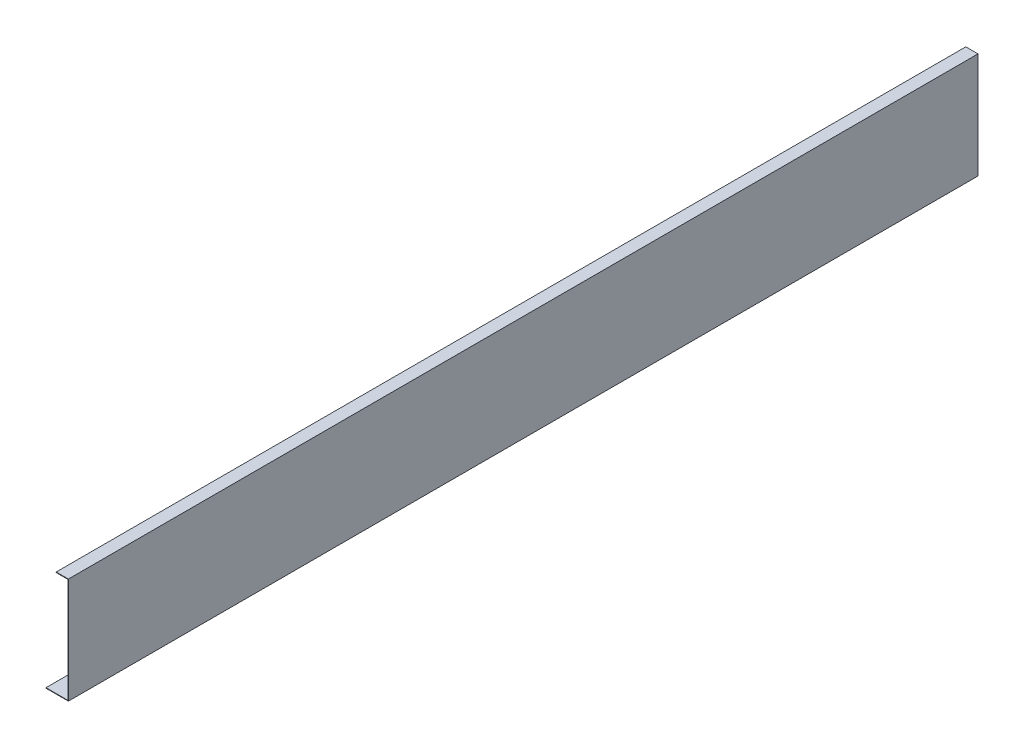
ISO-10303-21;
HEADER;
FILE_DESCRIPTION(('STEP AP214'),'2;1');
FILE_NAME('part.step','',(''),(''),'','','');
FILE_SCHEMA(('AUTOMOTIVE_DESIGN { 1 0 10303 214 1 1 1 1 }'));
ENDSEC;
DATA;
#1=APPLICATION_CONTEXT('core data for automotive mechanical design processes');
#2=APPLICATION_PROTOCOL_DEFINITION('international standard','automotive_design',2000,#1);
#3=PRODUCT_CONTEXT('',#1,'mechanical');
#4=PRODUCT('Part','Part','',(#3));
#5=PRODUCT_RELATED_PRODUCT_CATEGORY('part','',(#4));
#6=PRODUCT_DEFINITION_FORMATION('','',#4);
#7=PRODUCT_DEFINITION_CONTEXT('part definition',#1,'design');
#8=PRODUCT_DEFINITION('design','',#6,#7);
#9=PRODUCT_DEFINITION_SHAPE('','',#8);
#10=(LENGTH_UNIT() NAMED_UNIT(*) SI_UNIT(.MILLI.,.METRE.));
#11=(NAMED_UNIT(*) PLANE_ANGLE_UNIT() SI_UNIT($,.RADIAN.));
#12=(NAMED_UNIT(*) SI_UNIT($,.STERADIAN.) SOLID_ANGLE_UNIT());
#13=UNCERTAINTY_MEASURE_WITH_UNIT(LENGTH_MEASURE(1.E-05),#10,'distance_accuracy_value','');
#14=(GEOMETRIC_REPRESENTATION_CONTEXT(3) GLOBAL_UNCERTAINTY_ASSIGNED_CONTEXT((#13)) GLOBAL_UNIT_ASSIGNED_CONTEXT((#10,
#11,#12)) REPRESENTATION_CONTEXT('',''));
#15=CARTESIAN_POINT('',(0.,0.,0.));
#16=DIRECTION('',(0.,0.,1.));
#17=DIRECTION('',(1.,0.,0.));
#18=AXIS2_PLACEMENT_3D('',#15,#16,#17);
#19=CARTESIAN_POINT('',(0.,20.,1118.));
#20=DIRECTION('',(1.,0.,0.));
#21=DIRECTION('',(0.,0.,-1.));
#22=AXIS2_PLACEMENT_3D('',#19,#20,#21);
#23=PLANE('',#22);
#24=DIRECTION('',(0.,0.,-1.));
#25=VECTOR('',#24,1.);
#26=CARTESIAN_POINT('',(0.,0.,1118.));
#27=LINE('',#26,#25);
#28=CARTESIAN_POINT('',(0.,0.,1085.5));
#29=VERTEX_POINT('',#28);
#30=CARTESIAN_POINT('',(0.,0.,32.5));
#31=VERTEX_POINT('',#30);
#32=EDGE_CURVE('E148',#29,#31,#27,.T.);
#33=ORIENTED_EDGE('',*,*,#32,.F.);
#34=DIRECTION('',(0.,-1.,0.));
#35=VECTOR('',#34,1.);
#36=CARTESIAN_POINT('',(0.,130.,1085.5));
#37=LINE('',#36,#35);
#38=CARTESIAN_POINT('',(0.,20.,1085.5));
#39=VERTEX_POINT('',#38);
#40=EDGE_CURVE('E134',#39,#29,#37,.T.);
#41=ORIENTED_EDGE('',*,*,#40,.F.);
#42=DIRECTION('',(0.,0.,-1.));
#43=VECTOR('',#42,1.);
#44=CARTESIAN_POINT('',(0.,20.,1118.));
#45=LINE('',#44,#43);
#46=CARTESIAN_POINT('',(0.,20.,32.5));
#47=VERTEX_POINT('',#46);
#48=EDGE_CURVE('E184',#39,#47,#45,.T.);
#49=ORIENTED_EDGE('',*,*,#48,.T.);
#50=DIRECTION('',(0.,-1.,0.));
#51=VECTOR('',#50,1.);
#52=CARTESIAN_POINT('',(0.,130.,32.5));
#53=LINE('',#52,#51);
#54=EDGE_CURVE('E153',#47,#31,#53,.T.);
#55=ORIENTED_EDGE('',*,*,#54,.T.);
#56=EDGE_LOOP('',(#33,#41,#49,#55));
#57=FACE_BOUND('',#56,.T.);
#58=ADVANCED_FACE('F33',(#57),#23,.F.);
#59=CARTESIAN_POINT('',(0.,0.,1118.));
#60=DIRECTION('',(0.,1.,0.));
#61=DIRECTION('',(0.,0.,1.));
#62=AXIS2_PLACEMENT_3D('',#59,#60,#61);
#63=PLANE('',#62);
#64=DIRECTION('',(1.,0.,0.));
#65=VECTOR('',#64,1.);
#66=CARTESIAN_POINT('',(0.,0.,1118.));
#67=LINE('',#66,#65);
#68=CARTESIAN_POINT('',(2.5,0.,1118.));
#69=VERTEX_POINT('',#68);
#70=CARTESIAN_POINT('',(30.,0.,1118.));
#71=VERTEX_POINT('',#70);
#72=EDGE_CURVE('E207',#69,#71,#67,.T.);
#73=ORIENTED_EDGE('',*,*,#72,.F.);
#74=DIRECTION('',(0.,0.,1.));
#75=VECTOR('',#74,1.);
#76=CARTESIAN_POINT('',(2.5,0.,1118.));
#77=LINE('',#76,#75);
#78=CARTESIAN_POINT('',(2.5,0.,1085.5));
#79=VERTEX_POINT('',#78);
#80=EDGE_CURVE('E47',#79,#69,#77,.T.);
#81=ORIENTED_EDGE('',*,*,#80,.F.);
#82=DIRECTION('',(1.,0.,0.));
#83=VECTOR('',#82,1.);
#84=CARTESIAN_POINT('',(0.,0.,1085.5));
#85=LINE('',#84,#83);
#86=EDGE_CURVE('E138',#29,#79,#85,.T.);
#87=ORIENTED_EDGE('',*,*,#86,.F.);
#88=ORIENTED_EDGE('',*,*,#32,.T.);
#89=DIRECTION('',(-1.,0.,0.));
#90=VECTOR('',#89,1.);
#91=CARTESIAN_POINT('',(0.,0.,32.5));
#92=LINE('',#91,#90);
#93=CARTESIAN_POINT('',(2.5,0.,32.5));
#94=VERTEX_POINT('',#93);
#95=EDGE_CURVE('E262',#94,#31,#92,.T.);
#96=ORIENTED_EDGE('',*,*,#95,.F.);
#97=DIRECTION('',(0.,0.,1.));
#98=VECTOR('',#97,1.);
#99=CARTESIAN_POINT('',(2.5,0.,0.));
#100=LINE('',#99,#98);
#101=CARTESIAN_POINT('',(2.5,0.,0.));
#102=VERTEX_POINT('',#101);
#103=EDGE_CURVE('E265',#102,#94,#100,.T.);
#104=ORIENTED_EDGE('',*,*,#103,.F.);
#105=DIRECTION('',(1.,0.,0.));
#106=VECTOR('',#105,1.);
#107=CARTESIAN_POINT('',(0.,0.,0.));
#108=LINE('',#107,#106);
#109=CARTESIAN_POINT('',(30.,0.,0.));
#110=VERTEX_POINT('',#109);
#111=EDGE_CURVE('E192',#102,#110,#108,.T.);
#112=ORIENTED_EDGE('',*,*,#111,.T.);
#113=DIRECTION('',(0.,0.,-1.));
#114=VECTOR('',#113,1.);
#115=CARTESIAN_POINT('',(30.,0.,1118.));
#116=LINE('',#115,#114);
#117=EDGE_CURVE('E155',#71,#110,#116,.T.);
#118=ORIENTED_EDGE('',*,*,#117,.F.);
#119=EDGE_LOOP('',(#73,#81,#87,#88,#96,#104,#112,#118));
#120=FACE_BOUND('',#119,.T.);
#121=ADVANCED_FACE('F146',(#120),#63,.F.);
#122=CARTESIAN_POINT('',(30.,0.,1118.));
#123=DIRECTION('',(-1.,0.,0.));
#124=DIRECTION('',(0.,0.,1.));
#125=AXIS2_PLACEMENT_3D('',#122,#123,#124);
#126=PLANE('',#125);
#127=DIRECTION('',(0.,1.,0.));
#128=VECTOR('',#127,1.);
#129=CARTESIAN_POINT('',(30.,0.,0.));
#130=LINE('',#129,#128);
#131=CARTESIAN_POINT('',(30.,130.,0.));
#132=VERTEX_POINT('',#131);
#133=EDGE_CURVE('E194',#110,#132,#130,.T.);
#134=ORIENTED_EDGE('',*,*,#133,.T.);
#135=DIRECTION('',(0.,0.,-1.));
#136=VECTOR('',#135,1.);
#137=CARTESIAN_POINT('',(30.,130.,1118.));
#138=LINE('',#137,#136);
#139=CARTESIAN_POINT('',(30.,130.,1118.));
#140=VERTEX_POINT('',#139);
#141=EDGE_CURVE('E160',#140,#132,#138,.T.);
#142=ORIENTED_EDGE('',*,*,#141,.F.);
#143=DIRECTION('',(0.,1.,0.));
#144=VECTOR('',#143,1.);
#145=CARTESIAN_POINT('',(30.,0.,1118.));
#146=LINE('',#145,#144);
#147=EDGE_CURVE('E251',#71,#140,#146,.T.);
#148=ORIENTED_EDGE('',*,*,#147,.F.);
#149=ORIENTED_EDGE('',*,*,#117,.T.);
#150=EDGE_LOOP('',(#134,#142,#148,#149));
#151=FACE_BOUND('',#150,.T.);
#152=ADVANCED_FACE('F297',(#151),#126,.F.);
#153=CARTESIAN_POINT('',(30.,130.,1118.));
#154=DIRECTION('',(0.,-1.,0.));
#155=DIRECTION('',(0.,0.,-1.));
#156=AXIS2_PLACEMENT_3D('',#153,#154,#155);
#157=PLANE('',#156);
#158=DIRECTION('',(-1.,0.,0.));
#159=VECTOR('',#158,1.);
#160=CARTESIAN_POINT('',(30.,130.,0.));
#161=LINE('',#160,#159);
#162=CARTESIAN_POINT('',(15.,130.,0.));
#163=VERTEX_POINT('',#162);
#164=EDGE_CURVE('E197',#132,#163,#161,.T.);
#165=ORIENTED_EDGE('',*,*,#164,.T.);
#166=DIRECTION('',(0.,0.,-1.));
#167=VECTOR('',#166,1.);
#168=CARTESIAN_POINT('',(15.,130.,1118.));
#169=LINE('',#168,#167);
#170=CARTESIAN_POINT('',(15.,130.,1118.));
#171=VERTEX_POINT('',#170);
#172=EDGE_CURVE('E220',#171,#163,#169,.T.);
#173=ORIENTED_EDGE('',*,*,#172,.F.);
#174=DIRECTION('',(-1.,0.,0.));
#175=VECTOR('',#174,1.);
#176=CARTESIAN_POINT('',(30.,130.,1118.));
#177=LINE('',#176,#175);
#178=EDGE_CURVE('E229',#140,#171,#177,.T.);
#179=ORIENTED_EDGE('',*,*,#178,.F.);
#180=ORIENTED_EDGE('',*,*,#141,.T.);
#181=EDGE_LOOP('',(#165,#173,#179,#180));
#182=FACE_BOUND('',#181,.T.);
#183=ADVANCED_FACE('F227',(#182),#157,.F.);
#184=CARTESIAN_POINT('',(15.,130.,1118.));
#185=DIRECTION('',(1.,0.,0.));
#186=DIRECTION('',(0.,0.,-1.));
#187=AXIS2_PLACEMENT_3D('',#184,#185,#186);
#188=PLANE('',#187);
#189=DIRECTION('',(0.,-1.,0.));
#190=VECTOR('',#189,1.);
#191=CARTESIAN_POINT('',(15.,130.,0.));
#192=LINE('',#191,#190);
#193=CARTESIAN_POINT('',(15.,129.35,0.));
#194=VERTEX_POINT('',#193);
#195=EDGE_CURVE('E199',#163,#194,#192,.T.);
#196=ORIENTED_EDGE('',*,*,#195,.T.);
#197=DIRECTION('',(0.,0.,-1.));
#198=VECTOR('',#197,1.);
#199=CARTESIAN_POINT('',(15.,129.35,1118.));
#200=LINE('',#199,#198);
#201=CARTESIAN_POINT('',(15.,129.35,1118.));
#202=VERTEX_POINT('',#201);
#203=EDGE_CURVE('E217',#202,#194,#200,.T.);
#204=ORIENTED_EDGE('',*,*,#203,.F.);
#205=DIRECTION('',(0.,-1.,0.));
#206=VECTOR('',#205,1.);
#207=CARTESIAN_POINT('',(15.,130.,1118.));
#208=LINE('',#207,#206);
#209=EDGE_CURVE('E247',#171,#202,#208,.T.);
#210=ORIENTED_EDGE('',*,*,#209,.F.);
#211=ORIENTED_EDGE('',*,*,#172,.T.);
#212=EDGE_LOOP('',(#196,#204,#210,#211));
#213=FACE_BOUND('',#212,.T.);
#214=ADVANCED_FACE('F241',(#213),#188,.F.);
#215=CARTESIAN_POINT('',(15.,129.35,1118.));
#216=DIRECTION('',(0.,1.,0.));
#217=DIRECTION('',(0.,0.,1.));
#218=AXIS2_PLACEMENT_3D('',#215,#216,#217);
#219=PLANE('',#218);
#220=DIRECTION('',(1.,0.,0.));
#221=VECTOR('',#220,1.);
#222=CARTESIAN_POINT('',(15.,129.35,0.));
#223=LINE('',#222,#221);
#224=CARTESIAN_POINT('',(29.35,129.35,0.));
#225=VERTEX_POINT('',#224);
#226=EDGE_CURVE('E201',#194,#225,#223,.T.);
#227=ORIENTED_EDGE('',*,*,#226,.T.);
#228=DIRECTION('',(0.,0.,-1.));
#229=VECTOR('',#228,1.);
#230=CARTESIAN_POINT('',(29.35,129.35,1118.));
#231=LINE('',#230,#229);
#232=CARTESIAN_POINT('',(29.35,129.35,1118.));
#233=VERTEX_POINT('',#232);
#234=EDGE_CURVE('E214',#233,#225,#231,.T.);
#235=ORIENTED_EDGE('',*,*,#234,.F.);
#236=DIRECTION('',(1.,0.,0.));
#237=VECTOR('',#236,1.);
#238=CARTESIAN_POINT('',(15.,129.35,1118.));
#239=LINE('',#238,#237);
#240=EDGE_CURVE('E188',#202,#233,#239,.T.);
#241=ORIENTED_EDGE('',*,*,#240,.F.);
#242=ORIENTED_EDGE('',*,*,#203,.T.);
#243=EDGE_LOOP('',(#227,#235,#241,#242));
#244=FACE_BOUND('',#243,.T.);
#245=ADVANCED_FACE('F245',(#244),#219,.F.);
#246=CARTESIAN_POINT('',(29.35,129.35,1118.));
#247=DIRECTION('',(1.,0.,0.));
#248=DIRECTION('',(0.,1.,0.));
#249=AXIS2_PLACEMENT_3D('',#246,#247,#248);
#250=PLANE('',#249);
#251=DIRECTION('',(0.,-1.,0.));
#252=VECTOR('',#251,1.);
#253=CARTESIAN_POINT('',(29.35,129.35,0.));
#254=LINE('',#253,#252);
#255=CARTESIAN_POINT('',(29.35,0.650000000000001,0.));
#256=VERTEX_POINT('',#255);
#257=EDGE_CURVE('E203',#225,#256,#254,.T.);
#258=ORIENTED_EDGE('',*,*,#257,.T.);
#259=DIRECTION('',(0.,0.,-1.));
#260=VECTOR('',#259,1.);
#261=CARTESIAN_POINT('',(29.35,0.650000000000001,1118.));
#262=LINE('',#261,#260);
#263=CARTESIAN_POINT('',(29.35,0.650000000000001,1118.));
#264=VERTEX_POINT('',#263);
#265=EDGE_CURVE('E212',#264,#256,#262,.T.);
#266=ORIENTED_EDGE('',*,*,#265,.F.);
#267=DIRECTION('',(0.,-1.,0.));
#268=VECTOR('',#267,1.);
#269=CARTESIAN_POINT('',(29.35,129.35,1118.));
#270=LINE('',#269,#268);
#271=EDGE_CURVE('E182',#233,#264,#270,.T.);
#272=ORIENTED_EDGE('',*,*,#271,.F.);
#273=ORIENTED_EDGE('',*,*,#234,.T.);
#274=EDGE_LOOP('',(#258,#266,#272,#273));
#275=FACE_BOUND('',#274,.T.);
#276=ADVANCED_FACE('F310',(#275),#250,.F.);
#277=CARTESIAN_POINT('',(29.35,0.650000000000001,1118.));
#278=DIRECTION('',(0.,-1.,0.));
#279=DIRECTION('',(1.,0.,0.));
#280=AXIS2_PLACEMENT_3D('',#277,#278,#279);
#281=PLANE('',#280);
#282=DIRECTION('',(1.,0.,0.));
#283=VECTOR('',#282,1.);
#284=CARTESIAN_POINT('',(29.35,0.650000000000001,1085.5));
#285=LINE('',#284,#283);
#286=CARTESIAN_POINT('',(0.650000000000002,0.649999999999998,1085.5));
#287=VERTEX_POINT('',#286);
#288=CARTESIAN_POINT('',(2.5,0.650000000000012,1085.5));
#289=VERTEX_POINT('',#288);
#290=EDGE_CURVE('E177',#287,#289,#285,.T.);
#291=ORIENTED_EDGE('',*,*,#290,.T.);
#292=DIRECTION('',(0.,0.,1.));
#293=VECTOR('',#292,1.);
#294=CARTESIAN_POINT('',(2.5,0.649999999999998,1118.));
#295=LINE('',#294,#293);
#296=CARTESIAN_POINT('',(2.5,0.650000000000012,1118.));
#297=VERTEX_POINT('',#296);
#298=EDGE_CURVE('E167',#289,#297,#295,.T.);
#299=ORIENTED_EDGE('',*,*,#298,.T.);
#300=DIRECTION('',(-1.,0.,0.));
#301=VECTOR('',#300,1.);
#302=CARTESIAN_POINT('',(29.35,0.650000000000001,1118.));
#303=LINE('',#302,#301);
#304=EDGE_CURVE('E175',#264,#297,#303,.T.);
#305=ORIENTED_EDGE('',*,*,#304,.F.);
#306=ORIENTED_EDGE('',*,*,#265,.T.);
#307=DIRECTION('',(-1.,0.,0.));
#308=VECTOR('',#307,1.);
#309=CARTESIAN_POINT('',(29.35,0.650000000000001,0.));
#310=LINE('',#309,#308);
#311=CARTESIAN_POINT('',(2.50000000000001,0.649999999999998,0.));
#312=VERTEX_POINT('',#311);
#313=EDGE_CURVE('E205',#256,#312,#310,.T.);
#314=ORIENTED_EDGE('',*,*,#313,.T.);
#315=DIRECTION('',(0.,0.,1.));
#316=VECTOR('',#315,1.);
#317=CARTESIAN_POINT('',(2.5,0.649999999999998,1118.));
#318=LINE('',#317,#316);
#319=CARTESIAN_POINT('',(2.5,0.650000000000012,32.5));
#320=VERTEX_POINT('',#319);
#321=EDGE_CURVE('E55',#312,#320,#318,.T.);
#322=ORIENTED_EDGE('',*,*,#321,.T.);
#323=DIRECTION('',(-1.,0.,0.));
#324=VECTOR('',#323,1.);
#325=CARTESIAN_POINT('',(29.35,0.650000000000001,32.5));
#326=LINE('',#325,#324);
#327=CARTESIAN_POINT('',(0.650000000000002,0.649999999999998,32.5));
#328=VERTEX_POINT('',#327);
#329=EDGE_CURVE('E195',#320,#328,#326,.T.);
#330=ORIENTED_EDGE('',*,*,#329,.T.);
#331=DIRECTION('',(0.,0.,-1.));
#332=VECTOR('',#331,1.);
#333=CARTESIAN_POINT('',(0.650000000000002,0.649999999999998,1118.));
#334=LINE('',#333,#332);
#335=EDGE_CURVE('E210',#287,#328,#334,.T.);
#336=ORIENTED_EDGE('',*,*,#335,.F.);
#337=EDGE_LOOP('',(#291,#299,#305,#306,#314,#322,#330,#336));
#338=FACE_BOUND('',#337,.T.);
#339=ADVANCED_FACE('F173',(#338),#281,.F.);
#340=CARTESIAN_POINT('',(0.65,20.,1118.));
#341=DIRECTION('',(-1.,0.,0.));
#342=DIRECTION('',(0.,-1.,0.));
#343=AXIS2_PLACEMENT_3D('',#340,#341,#342);
#344=PLANE('',#343);
#345=DIRECTION('',(0.,0.,-1.));
#346=VECTOR('',#345,1.);
#347=CARTESIAN_POINT('',(0.65,20.,1118.));
#348=LINE('',#347,#346);
#349=CARTESIAN_POINT('',(0.65,20.,1085.5));
#350=VERTEX_POINT('',#349);
#351=CARTESIAN_POINT('',(0.65,20.,32.5));
#352=VERTEX_POINT('',#351);
#353=EDGE_CURVE('E186',#350,#352,#348,.T.);
#354=ORIENTED_EDGE('',*,*,#353,.F.);
#355=DIRECTION('',(0.,-1.,0.));
#356=VECTOR('',#355,1.);
#357=CARTESIAN_POINT('',(0.65,20.,1085.5));
#358=LINE('',#357,#356);
#359=EDGE_CURVE('E178',#350,#287,#358,.T.);
#360=ORIENTED_EDGE('',*,*,#359,.T.);
#361=ORIENTED_EDGE('',*,*,#335,.T.);
#362=DIRECTION('',(0.,1.,0.));
#363=VECTOR('',#362,1.);
#364=CARTESIAN_POINT('',(0.65,20.,32.5));
#365=LINE('',#364,#363);
#366=EDGE_CURVE('E256',#328,#352,#365,.T.);
#367=ORIENTED_EDGE('',*,*,#366,.T.);
#368=EDGE_LOOP('',(#354,#360,#361,#367));
#369=FACE_BOUND('',#368,.T.);
#370=ADVANCED_FACE('F274',(#369),#344,.F.);
#371=CARTESIAN_POINT('',(0.,20.,1118.));
#372=DIRECTION('',(0.,-1.,0.));
#373=DIRECTION('',(0.,0.,-1.));
#374=AXIS2_PLACEMENT_3D('',#371,#372,#373);
#375=PLANE('',#374);
#376=ORIENTED_EDGE('',*,*,#48,.F.);
#377=DIRECTION('',(1.,0.,0.));
#378=VECTOR('',#377,1.);
#379=CARTESIAN_POINT('',(0.,20.,1085.5));
#380=LINE('',#379,#378);
#381=EDGE_CURVE('E11',#39,#350,#380,.T.);
#382=ORIENTED_EDGE('',*,*,#381,.T.);
#383=ORIENTED_EDGE('',*,*,#353,.T.);
#384=DIRECTION('',(-1.,0.,0.));
#385=VECTOR('',#384,1.);
#386=CARTESIAN_POINT('',(0.,20.,32.5));
#387=LINE('',#386,#385);
#388=EDGE_CURVE('E157',#352,#47,#387,.T.);
#389=ORIENTED_EDGE('',*,*,#388,.T.);
#390=EDGE_LOOP('',(#376,#382,#383,#389));
#391=FACE_BOUND('',#390,.T.);
#392=ADVANCED_FACE('F282',(#391),#375,.F.);
#393=CARTESIAN_POINT('',(0.,0.,1118.));
#394=DIRECTION('',(0.,0.,1.));
#395=DIRECTION('',(1.,0.,0.));
#396=AXIS2_PLACEMENT_3D('',#393,#394,#395);
#397=PLANE('',#396);
#398=DIRECTION('',(0.,1.,0.));
#399=VECTOR('',#398,1.);
#400=CARTESIAN_POINT('',(2.5,0.,1118.));
#401=LINE('',#400,#399);
#402=EDGE_CURVE('E40',#69,#297,#401,.T.);
#403=ORIENTED_EDGE('',*,*,#402,.F.);
#404=ORIENTED_EDGE('',*,*,#72,.T.);
#405=ORIENTED_EDGE('',*,*,#147,.T.);
#406=ORIENTED_EDGE('',*,*,#178,.T.);
#407=ORIENTED_EDGE('',*,*,#209,.T.);
#408=ORIENTED_EDGE('',*,*,#240,.T.);
#409=ORIENTED_EDGE('',*,*,#271,.T.);
#410=ORIENTED_EDGE('',*,*,#304,.T.);
#411=EDGE_LOOP('',(#403,#404,#405,#406,#407,#408,#409,#410));
#412=FACE_BOUND('',#411,.T.);
#413=ADVANCED_FACE('F180',(#412),#397,.T.);
#414=CARTESIAN_POINT('',(0.,0.,0.));
#415=DIRECTION('',(0.,0.,1.));
#416=DIRECTION('',(1.,0.,0.));
#417=AXIS2_PLACEMENT_3D('',#414,#415,#416);
#418=PLANE('',#417);
#419=ORIENTED_EDGE('',*,*,#111,.F.);
#420=DIRECTION('',(0.,1.,0.));
#421=VECTOR('',#420,1.);
#422=CARTESIAN_POINT('',(2.5,0.,0.));
#423=LINE('',#422,#421);
#424=EDGE_CURVE('E154',#102,#312,#423,.T.);
#425=ORIENTED_EDGE('',*,*,#424,.T.);
#426=ORIENTED_EDGE('',*,*,#313,.F.);
#427=ORIENTED_EDGE('',*,*,#257,.F.);
#428=ORIENTED_EDGE('',*,*,#226,.F.);
#429=ORIENTED_EDGE('',*,*,#195,.F.);
#430=ORIENTED_EDGE('',*,*,#164,.F.);
#431=ORIENTED_EDGE('',*,*,#133,.F.);
#432=EDGE_LOOP('',(#419,#425,#426,#427,#428,#429,#430,#431));
#433=FACE_BOUND('',#432,.T.);
#434=ADVANCED_FACE('F236',(#433),#418,.F.);
#435=CARTESIAN_POINT('',(0.,130.,32.5));
#436=DIRECTION('',(0.,0.,1.));
#437=DIRECTION('',(1.,0.,0.));
#438=AXIS2_PLACEMENT_3D('',#435,#436,#437);
#439=PLANE('',#438);
#440=DIRECTION('',(0.,-1.,0.));
#441=VECTOR('',#440,1.);
#442=CARTESIAN_POINT('',(2.5,130.,32.5));
#443=LINE('',#442,#441);
#444=EDGE_CURVE('E260',#320,#94,#443,.T.);
#445=ORIENTED_EDGE('',*,*,#444,.T.);
#446=ORIENTED_EDGE('',*,*,#95,.T.);
#447=ORIENTED_EDGE('',*,*,#54,.F.);
#448=ORIENTED_EDGE('',*,*,#388,.F.);
#449=ORIENTED_EDGE('',*,*,#366,.F.);
#450=ORIENTED_EDGE('',*,*,#329,.F.);
#451=EDGE_LOOP('',(#445,#446,#447,#448,#449,#450));
#452=FACE_BOUND('',#451,.T.);
#453=ADVANCED_FACE('F277',(#452),#439,.F.);
#454=CARTESIAN_POINT('',(2.5,130.,0.));
#455=DIRECTION('',(1.,0.,0.));
#456=DIRECTION('',(0.,0.,-1.));
#457=AXIS2_PLACEMENT_3D('',#454,#455,#456);
#458=PLANE('',#457);
#459=ORIENTED_EDGE('',*,*,#424,.F.);
#460=ORIENTED_EDGE('',*,*,#103,.T.);
#461=ORIENTED_EDGE('',*,*,#444,.F.);
#462=ORIENTED_EDGE('',*,*,#321,.F.);
#463=EDGE_LOOP('',(#459,#460,#461,#462));
#464=FACE_BOUND('',#463,.T.);
#465=ADVANCED_FACE('F279',(#464),#458,.F.);
#466=CARTESIAN_POINT('',(0.,130.,1085.5));
#467=DIRECTION('',(0.,0.,-1.));
#468=DIRECTION('',(-1.,0.,0.));
#469=AXIS2_PLACEMENT_3D('',#466,#467,#468);
#470=PLANE('',#469);
#471=ORIENTED_EDGE('',*,*,#359,.F.);
#472=ORIENTED_EDGE('',*,*,#381,.F.);
#473=ORIENTED_EDGE('',*,*,#40,.T.);
#474=ORIENTED_EDGE('',*,*,#86,.T.);
#475=DIRECTION('',(0.,-1.,0.));
#476=VECTOR('',#475,1.);
#477=CARTESIAN_POINT('',(2.5,130.,1085.5));
#478=LINE('',#477,#476);
#479=EDGE_CURVE('E142',#289,#79,#478,.T.);
#480=ORIENTED_EDGE('',*,*,#479,.F.);
#481=ORIENTED_EDGE('',*,*,#290,.F.);
#482=EDGE_LOOP('',(#471,#472,#473,#474,#480,#481));
#483=FACE_BOUND('',#482,.T.);
#484=ADVANCED_FACE('F136',(#483),#470,.F.);
#485=CARTESIAN_POINT('',(2.5,130.,1118.));
#486=DIRECTION('',(1.,0.,0.));
#487=DIRECTION('',(0.,0.,-1.));
#488=AXIS2_PLACEMENT_3D('',#485,#486,#487);
#489=PLANE('',#488);
#490=ORIENTED_EDGE('',*,*,#479,.T.);
#491=ORIENTED_EDGE('',*,*,#80,.T.);
#492=ORIENTED_EDGE('',*,*,#402,.T.);
#493=ORIENTED_EDGE('',*,*,#298,.F.);
#494=EDGE_LOOP('',(#490,#491,#492,#493));
#495=FACE_BOUND('',#494,.T.);
#496=ADVANCED_FACE('F166',(#495),#489,.F.);
#497=CLOSED_SHELL('',(#58,#121,#152,#183,#214,#245,#276,#339,#370,#392,#413,#434,#453,#465,#484,#496));
#498=MANIFOLD_SOLID_BREP('B2',#497);
#499=ADVANCED_BREP_SHAPE_REPRESENTATION('',(#18,#498),#14);
#500=SHAPE_DEFINITION_REPRESENTATION(#9,#499);
ENDSEC;
END-ISO-10303-21;
